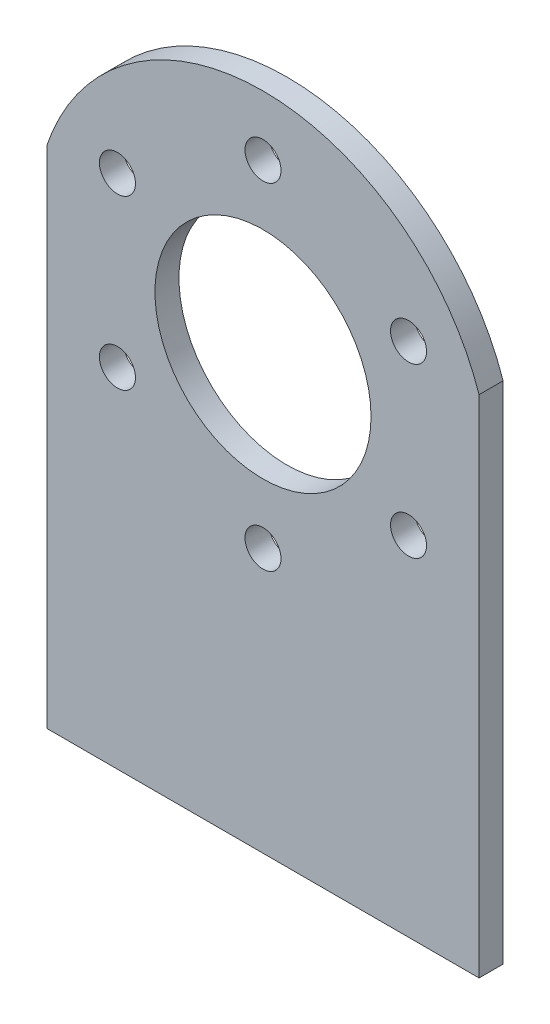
from build123d import *

# Parameters (mm, degrees)
SKETCH1_W           = 114.3
SKETCH1_H           = 6.35
BOSS_EXTRUDE1_DEPTH = 87.3125
CUT_EXTRUDE1_DEPTH  = 105.546246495
SKETCH5_R           = 28.575
CUT_EXTRUDE2_DEPTH  = 105.546246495
SKETCH6_R           = 4.7625
CUT_EXTRUDE3_DEPTH  = 105.546246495


with BuildPart() as part:
    # Sketch1 → Boss-Extrude1 (new, symmetric)
    with BuildSketch(Plane(origin=(0, 0, 0), x_dir=(1, 0, 0), z_dir=(0, 1, 0))):
        with Locations((0, 3.175)):
            Rectangle(SKETCH1_W, SKETCH1_H)
    extrude(amount=BOSS_EXTRUDE1_DEPTH, both=True)

    # Sketch4 → Cut-Extrude1 (cut, through all)
    with BuildSketch(Plane.XY):
        with BuildLine():
            Line((-57.15, 46.300271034), (-57.15, 94.549893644))
            Line((-57.15, 94.549893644), (57.15, 94.549893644))
            Line((57.15, 94.549893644), (57.15, 46.300271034))
            ThreePointArc((57.15, 46.300271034), (0, 87.3125), (-57.15, 46.300271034))
        make_face()
    extrude(amount=-CUT_EXTRUDE1_DEPTH, mode=Mode.SUBTRACT)

    # Sketch5 → Cut-Extrude2 (cut, through all)
    with BuildSketch(Plane.XY):
        with Locations((0, 26.9875)):
            Circle(SKETCH5_R)
    extrude(amount=-CUT_EXTRUDE2_DEPTH, mode=Mode.SUBTRACT)

    # Sketch6 → Cut-Extrude3 (cut, through all)
    with BuildSketch(Plane.XY):
        with Locations((0, 71.4375)):
            Circle(SKETCH6_R)
        with Locations((38.494829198, 49.2125)):
            Circle(SKETCH6_R)
        with Locations((38.494829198, 4.7625)):
            Circle(SKETCH6_R)
        with Locations((0, -17.4625)):
            Circle(SKETCH6_R)
        with Locations((-38.494829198, 4.7625)):
            Circle(SKETCH6_R)
        with Locations((-38.494829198, 49.2125)):
            Circle(SKETCH6_R)
    extrude(amount=-CUT_EXTRUDE3_DEPTH, mode=Mode.SUBTRACT)


solid = part.part
